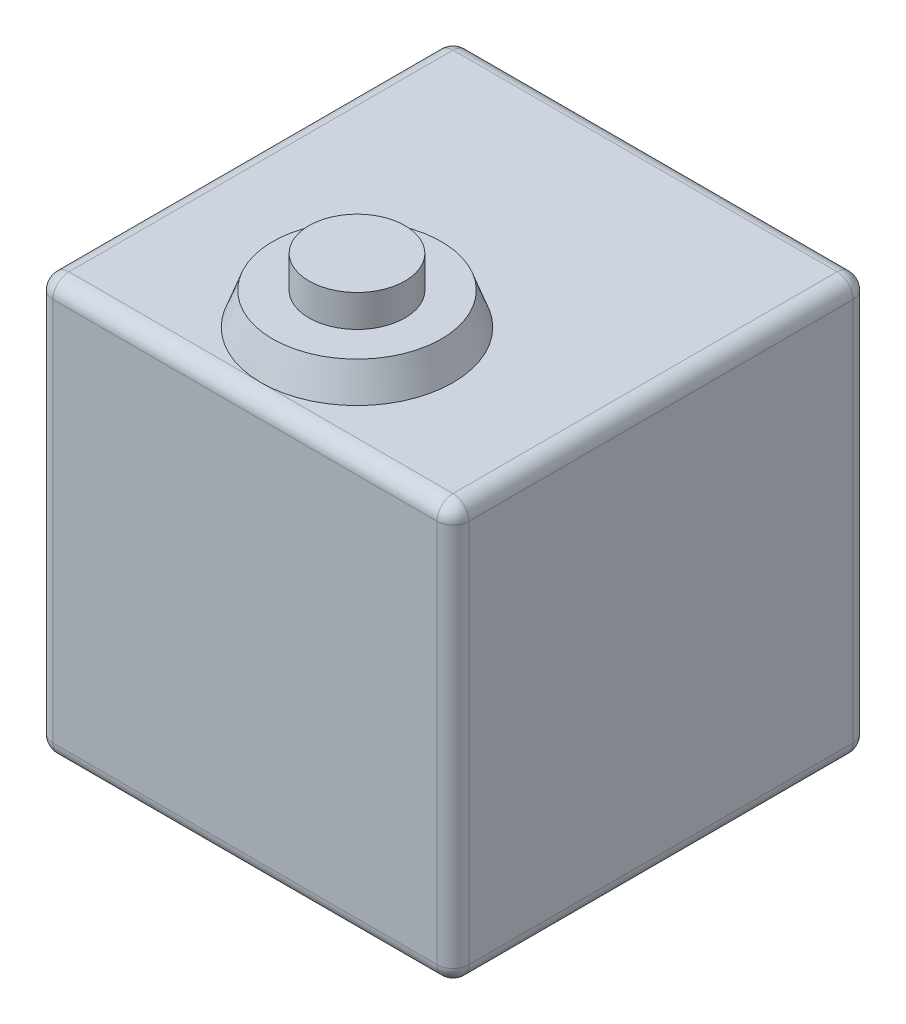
from build123d import *

# Parameters (mm, degrees)
SKETCH1_W           = 165.1
SKETCH1_H           = 165.1
BOSS_EXTRUDE1_DEPTH = 165.1
FILLET1_R           = 6.35
SKETCH2_R           = 38.1
BOSS_EXTRUDE2_DEPTH = 12.7
BOSS_EXTRUDE2_TAPER = 20
SKETCH3_R           = 19.05
BOSS_EXTRUDE3_DEPTH = 12.7


with BuildPart() as part:
    # Sketch1 → Boss-Extrude1 (new body)
    with BuildSketch(Plane(origin=(0, 0, 0), x_dir=(1, 0, 0), z_dir=(0, 1, 0))):
        Rectangle(SKETCH1_W, SKETCH1_H)
    extrude(amount=BOSS_EXTRUDE1_DEPTH)

    # Fillet1
    fillet1_edges = [part.edges().sort_by_distance(p)[0] for p in [
        (-82.55, 165.1, 0),
        (0, 165.1, 82.55),
        (82.55, 165.1, 0),
        (0, 0, 82.55),
        (-82.55, 0, 0),
        (0, 0, -82.55),
        (82.55, 0, 0),
        (82.55, 82.55, 82.55),
        (-82.55, 82.55, 82.55),
        (-82.55, 82.55, -82.55),
        (82.55, 82.55, -82.55),
        (0, 165.1, -82.55),
    ]]
    fillet(fillet1_edges, radius=FILLET1_R)

    # Sketch2 → Boss-Extrude2 (add)
    with BuildSketch(Plane(origin=(0, 165.1, 0), x_dir=(1, 0, 0), z_dir=(0, 1, 0))):
        with Locations((0, -38.1)):
            Circle(SKETCH2_R)
    extrude(amount=BOSS_EXTRUDE2_DEPTH, taper=BOSS_EXTRUDE2_TAPER)

    # Sketch3 → Boss-Extrude3 (add)
    with BuildSketch(Plane(origin=(0, 177.8, 0), x_dir=(1, 0, 0), z_dir=(0, 1, 0))):
        with Locations(Location((0, -38.1, 0), (0, 0, 270))):
            Circle(SKETCH3_R)
    extrude(amount=BOSS_EXTRUDE3_DEPTH)


solid = part.part
